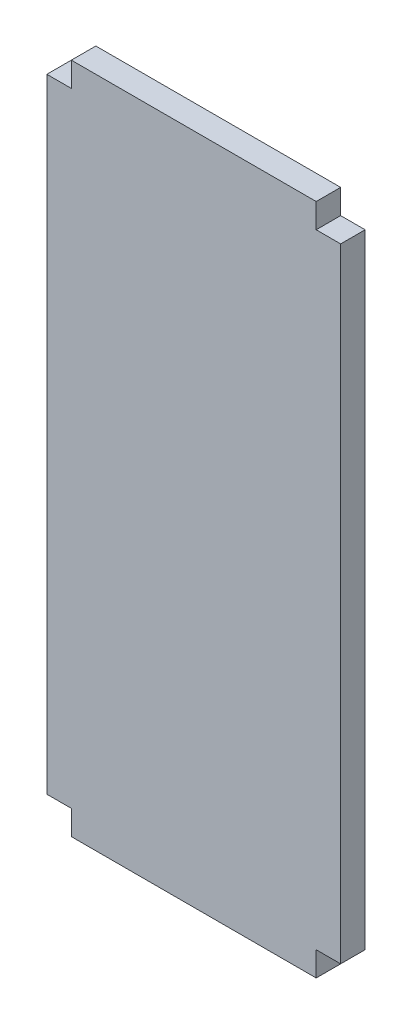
from build123d import *

# Parameters (mm, degrees)
CROQUIS1_W              = 36
CROQUIS1_H              = 76.4
SALIENTE_EXTRUIR1_DEPTH = 3
CROQUIS2_W              = 30
CROQUIS2_H              = 3
SALIENTE_EXTRUIR2_DEPTH = 3
CROQUIS3_W              = 30
CROQUIS3_H              = 3
SALIENTE_EXTRUIR3_DEPTH = 3


with BuildPart() as part:
    # Croquis1 → Saliente-Extruir1 (new body)
    with BuildSketch(Plane.XY):
        Rectangle(CROQUIS1_W, CROQUIS1_H)
    extrude(amount=SALIENTE_EXTRUIR1_DEPTH)

    # Croquis2 → Saliente-Extruir2 (add)
    with BuildSketch(Plane(origin=(0, 38.2, 0), x_dir=(1, 0, 0), z_dir=(0, 1, 0))):
        with Locations((0, -1.5)):
            Rectangle(CROQUIS2_W, CROQUIS2_H)
    extrude(amount=SALIENTE_EXTRUIR2_DEPTH)

    # Croquis3 → Saliente-Extruir3 (add)
    with BuildSketch(Plane.XZ.offset(38.2)):
        with Locations((0, 1.5)):
            Rectangle(CROQUIS3_W, CROQUIS3_H)
    extrude(amount=SALIENTE_EXTRUIR3_DEPTH)


solid = part.part
